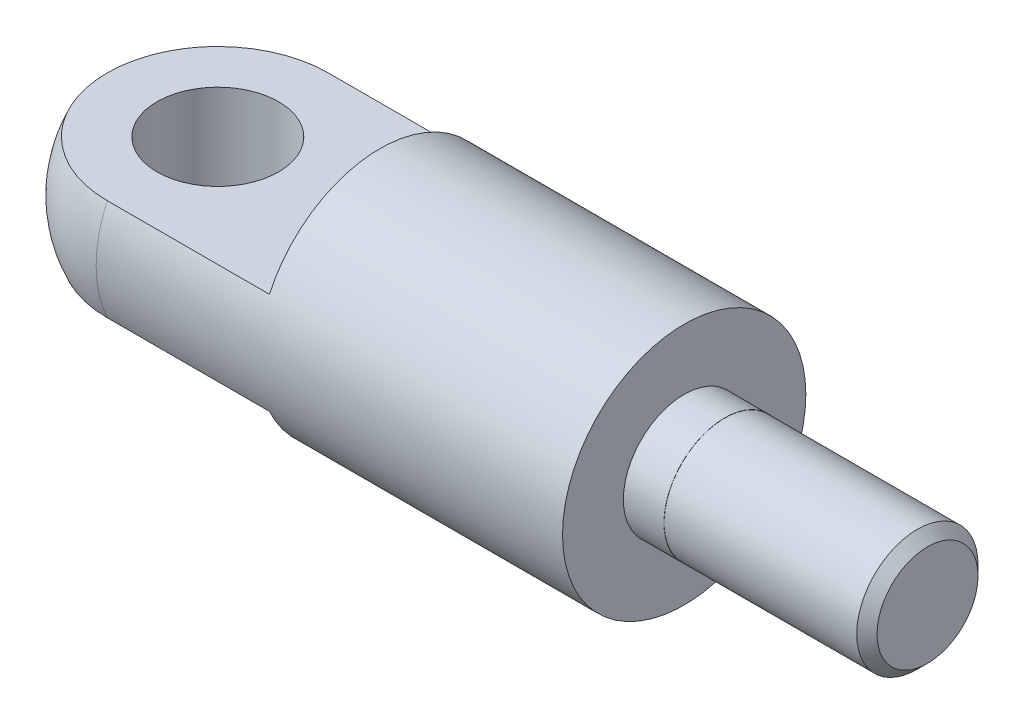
from build123d import *

# Parameters (mm, degrees)
SKETCH2_W          = 14
SKETCH2_H          = 6.156758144
SKETCH2_H_2        = 6.923408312
CUT_EXTRUDE1_DEPTH = 10
SKETCH3_R          = 3
CUT_EXTRUDE2_DEPTH = 20
SKETCH5_R          = 5.43343485
SKETCH5_R_2        = 2.99
CUT_EXTRUDE4_DEPTH = 10
CHAMFER1_SIZE      = 0.5


with BuildPart() as part:
    # Sketch1 → Revolve1 (revolve)
    with BuildSketch(Plane(origin=(0, 0, 0), x_dir=(1, 0, 0), z_dir=(0, 1, 0)), mode=Mode.PRIVATE) as revolve1_sk:
        with BuildLine():
            Line((0, 0), (41, 0))
            Line((41, 0), (41, 3))
            Line((41, 3), (29, 3))
            Line((29, 3), (29, 6))
            Line((29, 6), (6, 6))
            ThreePointArc((6, 6), (1.757359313, 4.242640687), (0, 0))
        make_face()
    revolve(revolve1_sk.sketch.rotate(Axis((0, 0, 0), (1, 0, 0)), 180), axis=Axis((0, 0, 0), (1, 0, 0)))

    # Sketch2 → Cut-Extrude1 (cut, symmetric)
    with BuildSketch(Plane.XY):
        with Locations((7, -5.578379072)):
            Rectangle(SKETCH2_W, SKETCH2_H)
        with Locations((7, 5.961704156)):
            Rectangle(SKETCH2_W, SKETCH2_H_2)
    extrude(amount=CUT_EXTRUDE1_DEPTH, both=True, mode=Mode.SUBTRACT)

    # Sketch3 → Cut-Extrude2 (cut)
    with BuildSketch(Plane(origin=(0, 2.5, 0), x_dir=(-1, 0, 0), z_dir=(0, 1, 0))):
        with Locations(Location((-6, 0, 0), (0, 0, 90))):
            Circle(SKETCH3_R)
    extrude(amount=-CUT_EXTRUDE2_DEPTH, mode=Mode.SUBTRACT)

    # Sketch5 → Cut-Extrude4 (cut)
    with BuildSketch(Plane(origin=(41, 0, 0), x_dir=(0, 0, -1), z_dir=(1, 0, 0))):
        Circle(SKETCH5_R)
        Circle(SKETCH5_R_2, mode=Mode.SUBTRACT)
    extrude(amount=-CUT_EXTRUDE4_DEPTH, mode=Mode.SUBTRACT)

    # Chamfer1
    chamfer1_edges = [part.edges().sort_by_distance(p)[0] for p in [
        (41, 0, 2.99),
    ]]
    chamfer(chamfer1_edges, length=CHAMFER1_SIZE)


solid = part.part
